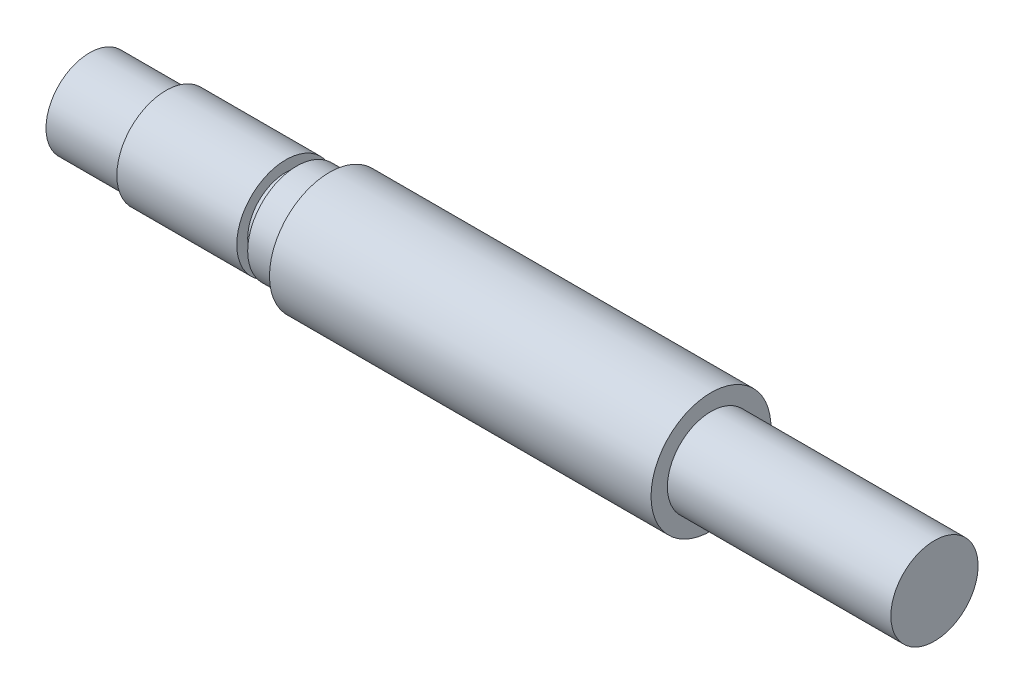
ISO-10303-21;
HEADER;
FILE_DESCRIPTION(('STEP AP214'),'2;1');
FILE_NAME('part.step','',(''),(''),'','','');
FILE_SCHEMA(('AUTOMOTIVE_DESIGN { 1 0 10303 214 1 1 1 1 }'));
ENDSEC;
DATA;
#1=APPLICATION_CONTEXT('core data for automotive mechanical design processes');
#2=APPLICATION_PROTOCOL_DEFINITION('international standard','automotive_design',2000,#1);
#3=PRODUCT_CONTEXT('',#1,'mechanical');
#4=PRODUCT('Part','Part','',(#3));
#5=PRODUCT_RELATED_PRODUCT_CATEGORY('part','',(#4));
#6=PRODUCT_DEFINITION_FORMATION('','',#4);
#7=PRODUCT_DEFINITION_CONTEXT('part definition',#1,'design');
#8=PRODUCT_DEFINITION('design','',#6,#7);
#9=PRODUCT_DEFINITION_SHAPE('','',#8);
#10=(LENGTH_UNIT() NAMED_UNIT(*) SI_UNIT(.MILLI.,.METRE.));
#11=(NAMED_UNIT(*) PLANE_ANGLE_UNIT() SI_UNIT($,.RADIAN.));
#12=(NAMED_UNIT(*) SI_UNIT($,.STERADIAN.) SOLID_ANGLE_UNIT());
#13=UNCERTAINTY_MEASURE_WITH_UNIT(LENGTH_MEASURE(1.E-05),#10,'distance_accuracy_value','');
#14=(GEOMETRIC_REPRESENTATION_CONTEXT(3) GLOBAL_UNCERTAINTY_ASSIGNED_CONTEXT((#13)) GLOBAL_UNIT_ASSIGNED_CONTEXT((#10,
#11,#12)) REPRESENTATION_CONTEXT('',''));
#15=CARTESIAN_POINT('',(0.,0.,0.));
#16=DIRECTION('',(0.,0.,1.));
#17=DIRECTION('',(1.,0.,0.));
#18=AXIS2_PLACEMENT_3D('',#15,#16,#17);
#19=CARTESIAN_POINT('',(0.,0.,0.));
#20=DIRECTION('',(1.,0.,0.));
#21=DIRECTION('',(0.,0.,-1.));
#22=AXIS2_PLACEMENT_3D('',#19,#20,#21);
#23=PLANE('',#22);
#24=CARTESIAN_POINT('',(0.,0.,0.));
#25=DIRECTION('',(-1.,0.,0.));
#26=DIRECTION('',(0.,0.,1.));
#27=AXIS2_PLACEMENT_3D('',#24,#25,#26);
#28=CIRCLE('',#27,3.99999999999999);
#29=CARTESIAN_POINT('',(0.,0.,3.99999999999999));
#30=VERTEX_POINT('',#29);
#31=EDGE_CURVE('E10',#30,#30,#28,.T.);
#32=ORIENTED_EDGE('',*,*,#31,.T.);
#33=EDGE_LOOP('',(#32));
#34=FACE_BOUND('',#33,.T.);
#35=ADVANCED_FACE('F31',(#34),#23,.F.);
#36=CARTESIAN_POINT('',(0.,0.,0.));
#37=DIRECTION('',(-1.,0.,0.));
#38=DIRECTION('',(0.,0.,1.));
#39=AXIS2_PLACEMENT_3D('',#36,#37,#38);
#40=CYLINDRICAL_SURFACE('',#39,3.99999999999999);
#41=ORIENTED_EDGE('',*,*,#31,.F.);
#42=EDGE_LOOP('',(#41));
#43=FACE_BOUND('',#42,.T.);
#44=CARTESIAN_POINT('',(7.,0.,0.));
#45=DIRECTION('',(-1.,0.,0.));
#46=DIRECTION('',(0.,0.,1.));
#47=AXIS2_PLACEMENT_3D('',#44,#45,#46);
#48=CIRCLE('',#47,3.99999999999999);
#49=CARTESIAN_POINT('',(7.,0.,3.99999999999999));
#50=VERTEX_POINT('',#49);
#51=EDGE_CURVE('E37',#50,#50,#48,.T.);
#52=ORIENTED_EDGE('',*,*,#51,.T.);
#53=EDGE_LOOP('',(#52));
#54=FACE_BOUND('',#53,.T.);
#55=ADVANCED_FACE('F87',(#43,#54),#40,.T.);
#56=CARTESIAN_POINT('',(7.,3.99999999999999,0.));
#57=DIRECTION('',(1.,0.,0.));
#58=DIRECTION('',(0.,0.,-1.));
#59=AXIS2_PLACEMENT_3D('',#56,#57,#58);
#60=PLANE('',#59);
#61=ORIENTED_EDGE('',*,*,#51,.F.);
#62=EDGE_LOOP('',(#61));
#63=FACE_BOUND('',#62,.T.);
#64=CARTESIAN_POINT('',(7.,0.,0.));
#65=DIRECTION('',(-1.,0.,0.));
#66=DIRECTION('',(0.,0.,1.));
#67=AXIS2_PLACEMENT_3D('',#64,#65,#66);
#68=CIRCLE('',#67,4.5);
#69=CARTESIAN_POINT('',(7.,0.,4.5));
#70=VERTEX_POINT('',#69);
#71=EDGE_CURVE('E41',#70,#70,#68,.T.);
#72=ORIENTED_EDGE('',*,*,#71,.T.);
#73=EDGE_LOOP('',(#72));
#74=FACE_BOUND('',#73,.T.);
#75=ADVANCED_FACE('F91',(#63,#74),#60,.F.);
#76=CARTESIAN_POINT('',(0.,0.,0.));
#77=DIRECTION('',(-1.,0.,0.));
#78=DIRECTION('',(0.,0.,1.));
#79=AXIS2_PLACEMENT_3D('',#76,#77,#78);
#80=CYLINDRICAL_SURFACE('',#79,4.5);
#81=ORIENTED_EDGE('',*,*,#71,.F.);
#82=EDGE_LOOP('',(#81));
#83=FACE_BOUND('',#82,.T.);
#84=CARTESIAN_POINT('',(18.,0.,0.));
#85=DIRECTION('',(-1.,0.,0.));
#86=DIRECTION('',(0.,0.,1.));
#87=AXIS2_PLACEMENT_3D('',#84,#85,#86);
#88=CIRCLE('',#87,4.5);
#89=CARTESIAN_POINT('',(18.,0.,4.5));
#90=VERTEX_POINT('',#89);
#91=EDGE_CURVE('E45',#90,#90,#88,.T.);
#92=ORIENTED_EDGE('',*,*,#91,.T.);
#93=EDGE_LOOP('',(#92));
#94=FACE_BOUND('',#93,.T.);
#95=ADVANCED_FACE('F96',(#83,#94),#80,.T.);
#96=CARTESIAN_POINT('',(18.,4.5,0.));
#97=DIRECTION('',(-1.,0.,0.));
#98=DIRECTION('',(0.,0.,1.));
#99=AXIS2_PLACEMENT_3D('',#96,#97,#98);
#100=PLANE('',#99);
#101=ORIENTED_EDGE('',*,*,#91,.F.);
#102=EDGE_LOOP('',(#101));
#103=FACE_BOUND('',#102,.T.);
#104=CARTESIAN_POINT('',(18.,0.,0.));
#105=DIRECTION('',(-1.,0.,0.));
#106=DIRECTION('',(0.,0.,1.));
#107=AXIS2_PLACEMENT_3D('',#104,#105,#106);
#108=CIRCLE('',#107,3.5);
#109=CARTESIAN_POINT('',(18.,0.,3.5));
#110=VERTEX_POINT('',#109);
#111=EDGE_CURVE('E50',#110,#110,#108,.T.);
#112=ORIENTED_EDGE('',*,*,#111,.T.);
#113=EDGE_LOOP('',(#112));
#114=FACE_BOUND('',#113,.T.);
#115=ADVANCED_FACE('F102',(#103,#114),#100,.F.);
#116=CARTESIAN_POINT('',(0.,0.,0.));
#117=DIRECTION('',(-1.,0.,0.));
#118=DIRECTION('',(0.,0.,1.));
#119=AXIS2_PLACEMENT_3D('',#116,#117,#118);
#120=CYLINDRICAL_SURFACE('',#119,3.5);
#121=ORIENTED_EDGE('',*,*,#111,.F.);
#122=EDGE_LOOP('',(#121));
#123=FACE_BOUND('',#122,.T.);
#124=CARTESIAN_POINT('',(19.,0.,0.));
#125=DIRECTION('',(-1.,0.,0.));
#126=DIRECTION('',(0.,0.,1.));
#127=AXIS2_PLACEMENT_3D('',#124,#125,#126);
#128=CIRCLE('',#127,3.5);
#129=CARTESIAN_POINT('',(19.,0.,3.5));
#130=VERTEX_POINT('',#129);
#131=EDGE_CURVE('E53',#130,#130,#128,.T.);
#132=ORIENTED_EDGE('',*,*,#131,.T.);
#133=EDGE_LOOP('',(#132));
#134=FACE_BOUND('',#133,.T.);
#135=ADVANCED_FACE('F106',(#123,#134),#120,.T.);
#136=CARTESIAN_POINT('',(19.,3.5,0.));
#137=DIRECTION('',(1.,0.,0.));
#138=DIRECTION('',(0.,0.,-1.));
#139=AXIS2_PLACEMENT_3D('',#136,#137,#138);
#140=PLANE('',#139);
#141=ORIENTED_EDGE('',*,*,#131,.F.);
#142=EDGE_LOOP('',(#141));
#143=FACE_BOUND('',#142,.T.);
#144=CARTESIAN_POINT('',(19.,0.,0.));
#145=DIRECTION('',(-1.,0.,0.));
#146=DIRECTION('',(0.,0.,1.));
#147=AXIS2_PLACEMENT_3D('',#144,#145,#146);
#148=CIRCLE('',#147,4.5);
#149=CARTESIAN_POINT('',(19.,0.,4.5));
#150=VERTEX_POINT('',#149);
#151=EDGE_CURVE('E56',#150,#150,#148,.T.);
#152=ORIENTED_EDGE('',*,*,#151,.T.);
#153=EDGE_LOOP('',(#152));
#154=FACE_BOUND('',#153,.T.);
#155=ADVANCED_FACE('F110',(#143,#154),#140,.F.);
#156=CARTESIAN_POINT('',(0.,0.,0.));
#157=DIRECTION('',(-1.,0.,0.));
#158=DIRECTION('',(0.,0.,1.));
#159=AXIS2_PLACEMENT_3D('',#156,#157,#158);
#160=CYLINDRICAL_SURFACE('',#159,4.5);
#161=ORIENTED_EDGE('',*,*,#151,.F.);
#162=EDGE_LOOP('',(#161));
#163=FACE_BOUND('',#162,.T.);
#164=CARTESIAN_POINT('',(22.,0.,0.));
#165=DIRECTION('',(-1.,0.,0.));
#166=DIRECTION('',(0.,0.,1.));
#167=AXIS2_PLACEMENT_3D('',#164,#165,#166);
#168=CIRCLE('',#167,4.5);
#169=CARTESIAN_POINT('',(22.,0.,4.5));
#170=VERTEX_POINT('',#169);
#171=EDGE_CURVE('E59',#170,#170,#168,.T.);
#172=ORIENTED_EDGE('',*,*,#171,.T.);
#173=EDGE_LOOP('',(#172));
#174=FACE_BOUND('',#173,.T.);
#175=ADVANCED_FACE('F114',(#163,#174),#160,.T.);
#176=CARTESIAN_POINT('',(22.,4.5,0.));
#177=DIRECTION('',(1.,0.,0.));
#178=DIRECTION('',(0.,0.,-1.));
#179=AXIS2_PLACEMENT_3D('',#176,#177,#178);
#180=PLANE('',#179);
#181=ORIENTED_EDGE('',*,*,#171,.F.);
#182=EDGE_LOOP('',(#181));
#183=FACE_BOUND('',#182,.T.);
#184=CARTESIAN_POINT('',(22.,0.,0.));
#185=DIRECTION('',(-1.,0.,0.));
#186=DIRECTION('',(0.,0.,1.));
#187=AXIS2_PLACEMENT_3D('',#184,#185,#186);
#188=CIRCLE('',#187,5.49999999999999);
#189=CARTESIAN_POINT('',(22.,0.,5.49999999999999));
#190=VERTEX_POINT('',#189);
#191=EDGE_CURVE('E62',#190,#190,#188,.T.);
#192=ORIENTED_EDGE('',*,*,#191,.T.);
#193=EDGE_LOOP('',(#192));
#194=FACE_BOUND('',#193,.T.);
#195=ADVANCED_FACE('F118',(#183,#194),#180,.F.);
#196=CARTESIAN_POINT('',(0.,0.,0.));
#197=DIRECTION('',(-1.,0.,0.));
#198=DIRECTION('',(0.,0.,1.));
#199=AXIS2_PLACEMENT_3D('',#196,#197,#198);
#200=CYLINDRICAL_SURFACE('',#199,5.49999999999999);
#201=ORIENTED_EDGE('',*,*,#191,.F.);
#202=EDGE_LOOP('',(#201));
#203=FACE_BOUND('',#202,.T.);
#204=CARTESIAN_POINT('',(57.,0.,0.));
#205=DIRECTION('',(-1.,0.,0.));
#206=DIRECTION('',(0.,0.,1.));
#207=AXIS2_PLACEMENT_3D('',#204,#205,#206);
#208=CIRCLE('',#207,5.49999999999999);
#209=CARTESIAN_POINT('',(57.,0.,5.49999999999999));
#210=VERTEX_POINT('',#209);
#211=EDGE_CURVE('E65',#210,#210,#208,.T.);
#212=ORIENTED_EDGE('',*,*,#211,.T.);
#213=EDGE_LOOP('',(#212));
#214=FACE_BOUND('',#213,.T.);
#215=ADVANCED_FACE('F122',(#203,#214),#200,.T.);
#216=CARTESIAN_POINT('',(57.,5.49999999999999,0.));
#217=DIRECTION('',(-1.,0.,0.));
#218=DIRECTION('',(0.,0.,1.));
#219=AXIS2_PLACEMENT_3D('',#216,#217,#218);
#220=PLANE('',#219);
#221=ORIENTED_EDGE('',*,*,#211,.F.);
#222=EDGE_LOOP('',(#221));
#223=FACE_BOUND('',#222,.T.);
#224=CARTESIAN_POINT('',(57.,0.,0.));
#225=DIRECTION('',(-1.,0.,0.));
#226=DIRECTION('',(0.,0.,1.));
#227=AXIS2_PLACEMENT_3D('',#224,#225,#226);
#228=CIRCLE('',#227,3.99999999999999);
#229=CARTESIAN_POINT('',(57.,0.,3.99999999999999));
#230=VERTEX_POINT('',#229);
#231=EDGE_CURVE('E68',#230,#230,#228,.T.);
#232=ORIENTED_EDGE('',*,*,#231,.T.);
#233=EDGE_LOOP('',(#232));
#234=FACE_BOUND('',#233,.T.);
#235=ADVANCED_FACE('F83',(#223,#234),#220,.F.);
#236=CARTESIAN_POINT('',(0.,0.,0.));
#237=DIRECTION('',(-1.,0.,0.));
#238=DIRECTION('',(0.,0.,1.));
#239=AXIS2_PLACEMENT_3D('',#236,#237,#238);
#240=CYLINDRICAL_SURFACE('',#239,3.99999999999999);
#241=ORIENTED_EDGE('',*,*,#231,.F.);
#242=EDGE_LOOP('',(#241));
#243=FACE_BOUND('',#242,.T.);
#244=CARTESIAN_POINT('',(77.5,0.,0.));
#245=DIRECTION('',(-1.,0.,0.));
#246=DIRECTION('',(0.,0.,1.));
#247=AXIS2_PLACEMENT_3D('',#244,#245,#246);
#248=CIRCLE('',#247,3.99999999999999);
#249=CARTESIAN_POINT('',(77.5,0.,3.99999999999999));
#250=VERTEX_POINT('',#249);
#251=EDGE_CURVE('E71',#250,#250,#248,.T.);
#252=ORIENTED_EDGE('',*,*,#251,.T.);
#253=EDGE_LOOP('',(#252));
#254=FACE_BOUND('',#253,.T.);
#255=ADVANCED_FACE('F75',(#243,#254),#240,.T.);
#256=CARTESIAN_POINT('',(77.5,3.99999999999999,0.));
#257=DIRECTION('',(-1.,0.,0.));
#258=DIRECTION('',(0.,0.,1.));
#259=AXIS2_PLACEMENT_3D('',#256,#257,#258);
#260=PLANE('',#259);
#261=ORIENTED_EDGE('',*,*,#251,.F.);
#262=EDGE_LOOP('',(#261));
#263=FACE_BOUND('',#262,.T.);
#264=ADVANCED_FACE('F77',(#263),#260,.F.);
#265=CLOSED_SHELL('',(#35,#55,#75,#95,#115,#135,#155,#175,#195,#215,#235,#255,#264));
#266=MANIFOLD_SOLID_BREP('B2',#265);
#267=ADVANCED_BREP_SHAPE_REPRESENTATION('',(#18,#266),#14);
#268=SHAPE_DEFINITION_REPRESENTATION(#9,#267);
ENDSEC;
END-ISO-10303-21;
